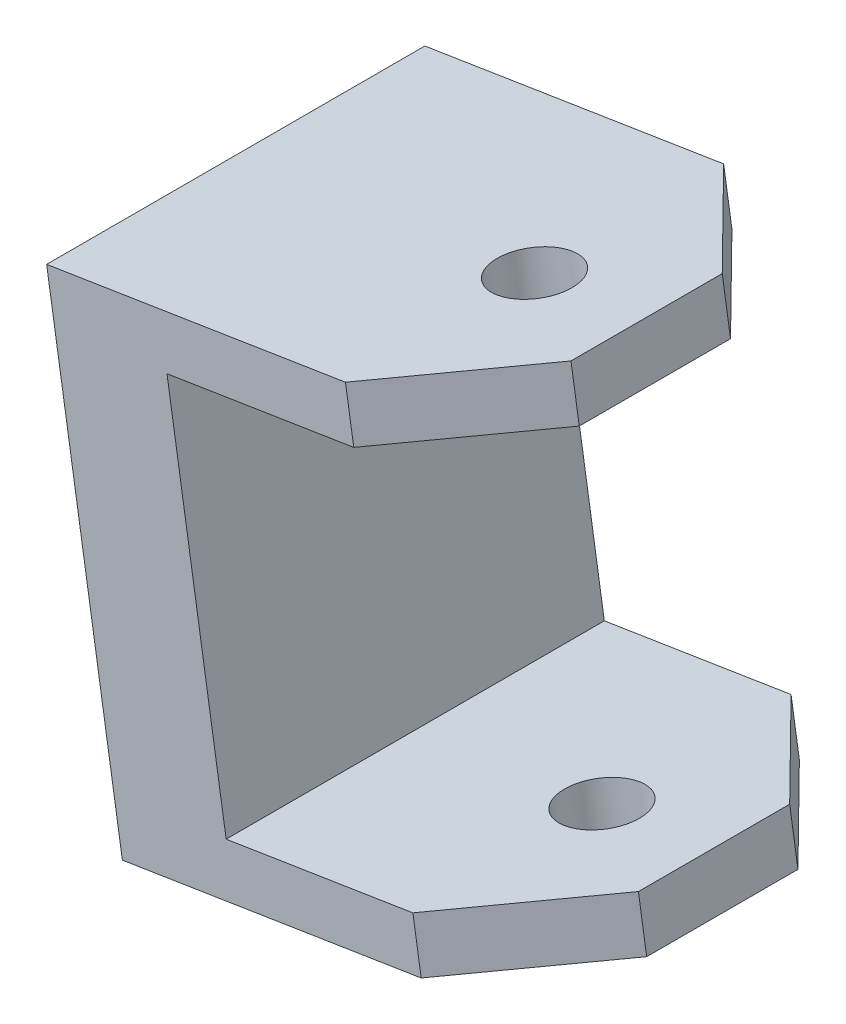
from build123d import *

# Parameters (mm, degrees)
BASE_EXTRUSION_DEPTH    = 25
CHANFREIN1_SIZE         = 15
ESQUISSE2_R             = 5
ENL_V_MAT_EXTRU_1_DEPTH = 351.605102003


with BuildPart() as part:
    # Esquisse1 → Base-Extrusion (new, symmetric)
    with BuildSketch(Plane.XY):
        Polygon((339.82122799, 26.740490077), (285.498369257, 18.136594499), (275.486563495, 81.348648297), (329.809422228, 89.952543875), (330.904463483, 83.03872549), (291.396929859, 76.781346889), (299.218653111, 27.396929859), (338.726186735, 33.654308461), align=None)
    extrude(amount=BASE_EXTRUSION_DEPTH, both=True)

    # Chanfrein1
    chanfrein1_edges = [part.edges().sort_by_distance(p)[0] for p in [
        (330.356942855, 86.495634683, 25),
        (339.273707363, 30.197399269, 25),
        (330.356942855, 86.495634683, -25),
        (339.273707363, 30.197399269, -25),
    ]]
    chamfer(chanfrein1_edges, length=CHANFREIN1_SIZE)

    # Esquisse2 → Enl_v. mat.-Extru.1 (cut, through all)
    with BuildSketch(Plane(origin=(-5.827421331, 36.792890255, 0), x_dir=(-0.9876883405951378, -0.1564344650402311, 0), z_dir=(-0.1564344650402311, 0.9876883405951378, 0))):
        with Locations((-324.820599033, 0)):
            Circle(ESQUISSE2_R)
    extrude(amount=-ENL_V_MAT_EXTRU_1_DEPTH, mode=Mode.SUBTRACT)


solid = part.part
